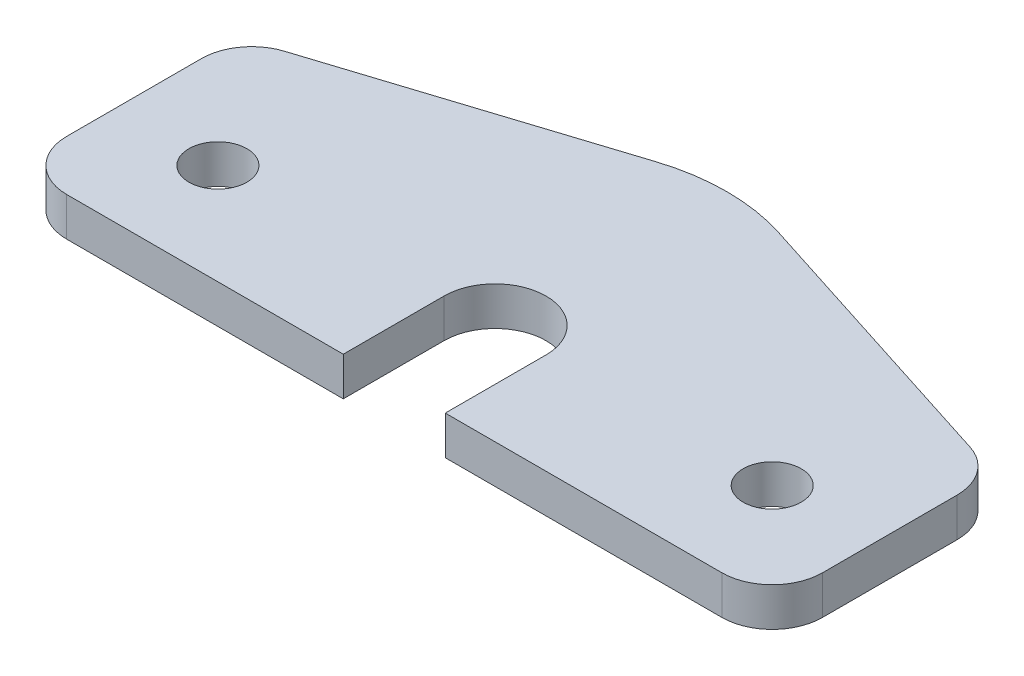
ISO-10303-21;
HEADER;
FILE_DESCRIPTION(('STEP AP214'),'2;1');
FILE_NAME('part.step','',(''),(''),'','','');
FILE_SCHEMA(('AUTOMOTIVE_DESIGN { 1 0 10303 214 1 1 1 1 }'));
ENDSEC;
DATA;
#1=APPLICATION_CONTEXT('core data for automotive mechanical design processes');
#2=APPLICATION_PROTOCOL_DEFINITION('international standard','automotive_design',2000,#1);
#3=PRODUCT_CONTEXT('',#1,'mechanical');
#4=PRODUCT('Part','Part','',(#3));
#5=PRODUCT_RELATED_PRODUCT_CATEGORY('part','',(#4));
#6=PRODUCT_DEFINITION_FORMATION('','',#4);
#7=PRODUCT_DEFINITION_CONTEXT('part definition',#1,'design');
#8=PRODUCT_DEFINITION('design','',#6,#7);
#9=PRODUCT_DEFINITION_SHAPE('','',#8);
#10=(LENGTH_UNIT() NAMED_UNIT(*) SI_UNIT(.MILLI.,.METRE.));
#11=(NAMED_UNIT(*) PLANE_ANGLE_UNIT() SI_UNIT($,.RADIAN.));
#12=(NAMED_UNIT(*) SI_UNIT($,.STERADIAN.) SOLID_ANGLE_UNIT());
#13=UNCERTAINTY_MEASURE_WITH_UNIT(LENGTH_MEASURE(1.E-05),#10,'distance_accuracy_value','');
#14=(GEOMETRIC_REPRESENTATION_CONTEXT(3) GLOBAL_UNCERTAINTY_ASSIGNED_CONTEXT((#13)) GLOBAL_UNIT_ASSIGNED_CONTEXT((#10,
#11,#12)) REPRESENTATION_CONTEXT('',''));
#15=CARTESIAN_POINT('',(0.,0.,0.));
#16=DIRECTION('',(0.,0.,1.));
#17=DIRECTION('',(1.,0.,0.));
#18=AXIS2_PLACEMENT_3D('',#15,#16,#17);
#19=CARTESIAN_POINT('',(0.,2.4384,-1.905));
#20=DIRECTION('',(0.,1.,0.));
#21=DIRECTION('',(0.,0.,1.));
#22=AXIS2_PLACEMENT_3D('',#19,#20,#21);
#23=PLANE('',#22);
#24=CARTESIAN_POINT('',(17.4625,2.4384,0.));
#25=DIRECTION('',(0.,1.,0.));
#26=DIRECTION('',(0.,0.,1.));
#27=AXIS2_PLACEMENT_3D('',#24,#25,#26);
#28=CIRCLE('',#27,1.8288);
#29=CARTESIAN_POINT('',(17.4625,2.4384,1.8288));
#30=VERTEX_POINT('',#29);
#31=EDGE_CURVE('E266',#30,#30,#28,.T.);
#32=ORIENTED_EDGE('',*,*,#31,.F.);
#33=EDGE_LOOP('',(#32));
#34=FACE_BOUND('',#33,.T.);
#35=DIRECTION('',(0.,0.,-1.));
#36=VECTOR('',#35,1.);
#37=CARTESIAN_POINT('',(23.8125,2.4384,6.35));
#38=LINE('',#37,#36);
#39=CARTESIAN_POINT('',(23.8125,2.4384,3.175));
#40=VERTEX_POINT('',#39);
#41=CARTESIAN_POINT('',(23.8125,2.4384,-5.30233425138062));
#42=VERTEX_POINT('',#41);
#43=EDGE_CURVE('E269',#40,#42,#38,.T.);
#44=ORIENTED_EDGE('',*,*,#43,.T.);
#45=CARTESIAN_POINT('',(20.6375,2.4384,-5.30233425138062));
#46=DIRECTION('',(0.,1.,0.));
#47=DIRECTION('',(0.,0.,1.));
#48=AXIS2_PLACEMENT_3D('',#45,#46,#47);
#49=CIRCLE('',#48,3.175);
#50=CARTESIAN_POINT('',(21.605079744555,2.4384,-8.32630753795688));
#51=VERTEX_POINT('',#50);
#52=EDGE_CURVE('E187',#42,#51,#49,.T.);
#53=ORIENTED_EDGE('',*,*,#52,.T.);
#54=DIRECTION('',(-0.952432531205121,0.,-0.304749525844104));
#55=VECTOR('',#54,1.);
#56=CARTESIAN_POINT('',(23.8125,2.4384,-7.62));
#57=LINE('',#56,#55);
#58=CARTESIAN_POINT('',(3.87031897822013,2.4384,-14.000893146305));
#59=VERTEX_POINT('',#58);
#60=EDGE_CURVE('E273',#51,#59,#57,.T.);
#61=ORIENTED_EDGE('',*,*,#60,.T.);
#62=CARTESIAN_POINT('',(0.,2.4384,-1.905));
#63=DIRECTION('',(0.,1.,0.));
#64=DIRECTION('',(0.,0.,1.));
#65=AXIS2_PLACEMENT_3D('',#62,#63,#64);
#66=CIRCLE('',#65,12.7);
#67=CARTESIAN_POINT('',(-3.87031897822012,2.4384,-14.000893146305));
#68=VERTEX_POINT('',#67);
#69=EDGE_CURVE('E262',#59,#68,#66,.T.);
#70=ORIENTED_EDGE('',*,*,#69,.T.);
#71=DIRECTION('',(-0.952432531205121,0.,0.304749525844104));
#72=VECTOR('',#71,1.);
#73=CARTESIAN_POINT('',(-23.8125,2.4384,-7.62));
#74=LINE('',#73,#72);
#75=CARTESIAN_POINT('',(-21.605079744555,2.4384,-8.32630753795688));
#76=VERTEX_POINT('',#75);
#77=EDGE_CURVE('E258',#68,#76,#74,.T.);
#78=ORIENTED_EDGE('',*,*,#77,.T.);
#79=CARTESIAN_POINT('',(-20.6375,2.4384,-5.30233425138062));
#80=DIRECTION('',(0.,1.,0.));
#81=DIRECTION('',(0.,0.,1.));
#82=AXIS2_PLACEMENT_3D('',#79,#80,#81);
#83=CIRCLE('',#82,3.175);
#84=CARTESIAN_POINT('',(-23.8125,2.4384,-5.30233425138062));
#85=VERTEX_POINT('',#84);
#86=EDGE_CURVE('E185',#76,#85,#83,.T.);
#87=ORIENTED_EDGE('',*,*,#86,.T.);
#88=DIRECTION('',(0.,0.,1.));
#89=VECTOR('',#88,1.);
#90=CARTESIAN_POINT('',(-23.8125,2.4384,6.35));
#91=LINE('',#90,#89);
#92=CARTESIAN_POINT('',(-23.8125,2.4384,3.175));
#93=VERTEX_POINT('',#92);
#94=EDGE_CURVE('E257',#85,#93,#91,.T.);
#95=ORIENTED_EDGE('',*,*,#94,.T.);
#96=CARTESIAN_POINT('',(-20.6375,2.4384,3.175));
#97=DIRECTION('',(0.,1.,0.));
#98=DIRECTION('',(0.,0.,1.));
#99=AXIS2_PLACEMENT_3D('',#96,#97,#98);
#100=CIRCLE('',#99,3.175);
#101=CARTESIAN_POINT('',(-20.6375,2.4384,6.35));
#102=VERTEX_POINT('',#101);
#103=EDGE_CURVE('E50',#93,#102,#100,.T.);
#104=ORIENTED_EDGE('',*,*,#103,.T.);
#105=DIRECTION('',(1.,0.,0.));
#106=VECTOR('',#105,1.);
#107=CARTESIAN_POINT('',(-23.8125,2.4384,6.35));
#108=LINE('',#107,#106);
#109=CARTESIAN_POINT('',(-3.2131,2.4384,6.35));
#110=VERTEX_POINT('',#109);
#111=EDGE_CURVE('E152',#102,#110,#108,.T.);
#112=ORIENTED_EDGE('',*,*,#111,.T.);
#113=DIRECTION('',(0.,0.,-1.));
#114=VECTOR('',#113,1.);
#115=CARTESIAN_POINT('',(-3.2131,2.4384,0.));
#116=LINE('',#115,#114);
#117=CARTESIAN_POINT('',(-3.2131,2.4384,0.));
#118=VERTEX_POINT('',#117);
#119=EDGE_CURVE('E147',#110,#118,#116,.T.);
#120=ORIENTED_EDGE('',*,*,#119,.T.);
#121=CARTESIAN_POINT('',(0.,2.4384,0.));
#122=DIRECTION('',(0.,-1.,0.));
#123=DIRECTION('',(0.,0.,1.));
#124=AXIS2_PLACEMENT_3D('',#121,#122,#123);
#125=CIRCLE('',#124,3.2131);
#126=CARTESIAN_POINT('',(3.2131,2.4384,0.));
#127=VERTEX_POINT('',#126);
#128=EDGE_CURVE('E137',#118,#127,#125,.T.);
#129=ORIENTED_EDGE('',*,*,#128,.T.);
#130=DIRECTION('',(0.,0.,1.));
#131=VECTOR('',#130,1.);
#132=CARTESIAN_POINT('',(3.2131,2.4384,0.));
#133=LINE('',#132,#131);
#134=CARTESIAN_POINT('',(3.2131,2.4384,6.35));
#135=VERTEX_POINT('',#134);
#136=EDGE_CURVE('E146',#127,#135,#133,.T.);
#137=ORIENTED_EDGE('',*,*,#136,.T.);
#138=DIRECTION('',(1.,0.,0.));
#139=VECTOR('',#138,1.);
#140=CARTESIAN_POINT('',(3.2131,2.4384,6.35));
#141=LINE('',#140,#139);
#142=CARTESIAN_POINT('',(20.6375,2.4384,6.35));
#143=VERTEX_POINT('',#142);
#144=EDGE_CURVE('E228',#135,#143,#141,.T.);
#145=ORIENTED_EDGE('',*,*,#144,.T.);
#146=CARTESIAN_POINT('',(20.6375,2.4384,3.175));
#147=DIRECTION('',(0.,1.,0.));
#148=DIRECTION('',(0.,0.,1.));
#149=AXIS2_PLACEMENT_3D('',#146,#147,#148);
#150=CIRCLE('',#149,3.175);
#151=EDGE_CURVE('E182',#143,#40,#150,.T.);
#152=ORIENTED_EDGE('',*,*,#151,.T.);
#153=EDGE_LOOP('',(#44,#53,#61,#70,#78,#87,#95,#104,#112,#120,#129,#137,#145,#152));
#154=FACE_BOUND('',#153,.T.);
#155=CARTESIAN_POINT('',(-17.4625,2.4384,0.));
#156=DIRECTION('',(0.,1.,0.));
#157=DIRECTION('',(0.,0.,-1.));
#158=AXIS2_PLACEMENT_3D('',#155,#156,#157);
#159=CIRCLE('',#158,1.8288);
#160=CARTESIAN_POINT('',(-17.4625,2.4384,-1.8288));
#161=VERTEX_POINT('',#160);
#162=EDGE_CURVE('E447',#161,#161,#159,.T.);
#163=ORIENTED_EDGE('',*,*,#162,.F.);
#164=EDGE_LOOP('',(#163));
#165=FACE_BOUND('',#164,.T.);
#166=ADVANCED_FACE('F35',(#34,#154,#165),#23,.T.);
#167=CARTESIAN_POINT('',(0.,0.,-1.905));
#168=DIRECTION('',(0.,1.,0.));
#169=DIRECTION('',(0.,0.,1.));
#170=AXIS2_PLACEMENT_3D('',#167,#168,#169);
#171=PLANE('',#170);
#172=CARTESIAN_POINT('',(17.4625,0.,0.));
#173=DIRECTION('',(0.,1.,0.));
#174=DIRECTION('',(0.,0.,1.));
#175=AXIS2_PLACEMENT_3D('',#172,#173,#174);
#176=CIRCLE('',#175,1.8288);
#177=CARTESIAN_POINT('',(17.4625,0.,1.8288));
#178=VERTEX_POINT('',#177);
#179=EDGE_CURVE('E446',#178,#178,#176,.T.);
#180=ORIENTED_EDGE('',*,*,#179,.T.);
#181=EDGE_LOOP('',(#180));
#182=FACE_BOUND('',#181,.T.);
#183=DIRECTION('',(-0.952432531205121,0.,-0.304749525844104));
#184=VECTOR('',#183,1.);
#185=CARTESIAN_POINT('',(23.8125,0.,-7.62));
#186=LINE('',#185,#184);
#187=CARTESIAN_POINT('',(21.605079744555,0.,-8.32630753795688));
#188=VERTEX_POINT('',#187);
#189=CARTESIAN_POINT('',(3.87031897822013,0.,-14.000893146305));
#190=VERTEX_POINT('',#189);
#191=EDGE_CURVE('E236',#188,#190,#186,.T.);
#192=ORIENTED_EDGE('',*,*,#191,.F.);
#193=CARTESIAN_POINT('',(20.6375,0.,-5.30233425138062));
#194=DIRECTION('',(0.,1.,0.));
#195=DIRECTION('',(0.,0.,1.));
#196=AXIS2_PLACEMENT_3D('',#193,#194,#195);
#197=CIRCLE('',#196,3.175);
#198=CARTESIAN_POINT('',(23.8125,0.,-5.30233425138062));
#199=VERTEX_POINT('',#198);
#200=EDGE_CURVE('E175',#188,#199,#197,.F.);
#201=ORIENTED_EDGE('',*,*,#200,.T.);
#202=DIRECTION('',(0.,0.,-1.));
#203=VECTOR('',#202,1.);
#204=CARTESIAN_POINT('',(23.8125,0.,6.35));
#205=LINE('',#204,#203);
#206=CARTESIAN_POINT('',(23.8125,0.,3.175));
#207=VERTEX_POINT('',#206);
#208=EDGE_CURVE('E233',#207,#199,#205,.T.);
#209=ORIENTED_EDGE('',*,*,#208,.F.);
#210=CARTESIAN_POINT('',(20.6375,0.,3.175));
#211=DIRECTION('',(0.,1.,0.));
#212=DIRECTION('',(0.,0.,1.));
#213=AXIS2_PLACEMENT_3D('',#210,#211,#212);
#214=CIRCLE('',#213,3.175);
#215=CARTESIAN_POINT('',(20.6375,0.,6.35));
#216=VERTEX_POINT('',#215);
#217=EDGE_CURVE('E164',#207,#216,#214,.F.);
#218=ORIENTED_EDGE('',*,*,#217,.T.);
#219=DIRECTION('',(1.,0.,0.));
#220=VECTOR('',#219,1.);
#221=CARTESIAN_POINT('',(3.2131,0.,6.35));
#222=LINE('',#221,#220);
#223=CARTESIAN_POINT('',(3.2131,0.,6.35));
#224=VERTEX_POINT('',#223);
#225=EDGE_CURVE('E225',#224,#216,#222,.T.);
#226=ORIENTED_EDGE('',*,*,#225,.F.);
#227=DIRECTION('',(0.,0.,1.));
#228=VECTOR('',#227,1.);
#229=CARTESIAN_POINT('',(3.2131,0.,0.));
#230=LINE('',#229,#228);
#231=CARTESIAN_POINT('',(3.2131,0.,0.));
#232=VERTEX_POINT('',#231);
#233=EDGE_CURVE('E231',#232,#224,#230,.T.);
#234=ORIENTED_EDGE('',*,*,#233,.F.);
#235=CARTESIAN_POINT('',(0.,0.,0.));
#236=DIRECTION('',(0.,-1.,0.));
#237=DIRECTION('',(0.,0.,1.));
#238=AXIS2_PLACEMENT_3D('',#235,#236,#237);
#239=CIRCLE('',#238,3.2131);
#240=CARTESIAN_POINT('',(-3.2131,0.,0.));
#241=VERTEX_POINT('',#240);
#242=EDGE_CURVE('E238',#241,#232,#239,.T.);
#243=ORIENTED_EDGE('',*,*,#242,.F.);
#244=DIRECTION('',(0.,0.,-1.));
#245=VECTOR('',#244,1.);
#246=CARTESIAN_POINT('',(-3.2131,0.,0.));
#247=LINE('',#246,#245);
#248=CARTESIAN_POINT('',(-3.2131,0.,6.35));
#249=VERTEX_POINT('',#248);
#250=EDGE_CURVE('E160',#249,#241,#247,.T.);
#251=ORIENTED_EDGE('',*,*,#250,.F.);
#252=DIRECTION('',(1.,0.,0.));
#253=VECTOR('',#252,1.);
#254=CARTESIAN_POINT('',(-23.8125,0.,6.35));
#255=LINE('',#254,#253);
#256=CARTESIAN_POINT('',(-20.6375,0.,6.35));
#257=VERTEX_POINT('',#256);
#258=EDGE_CURVE('E156',#257,#249,#255,.T.);
#259=ORIENTED_EDGE('',*,*,#258,.F.);
#260=CARTESIAN_POINT('',(-20.6375,0.,3.175));
#261=DIRECTION('',(0.,1.,0.));
#262=DIRECTION('',(0.,0.,1.));
#263=AXIS2_PLACEMENT_3D('',#260,#261,#262);
#264=CIRCLE('',#263,3.175);
#265=CARTESIAN_POINT('',(-23.8125,0.,3.175));
#266=VERTEX_POINT('',#265);
#267=EDGE_CURVE('E171',#257,#266,#264,.F.);
#268=ORIENTED_EDGE('',*,*,#267,.T.);
#269=DIRECTION('',(0.,0.,1.));
#270=VECTOR('',#269,1.);
#271=CARTESIAN_POINT('',(-23.8125,0.,6.35));
#272=LINE('',#271,#270);
#273=CARTESIAN_POINT('',(-23.8125,0.,-5.30233425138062));
#274=VERTEX_POINT('',#273);
#275=EDGE_CURVE('E205',#274,#266,#272,.T.);
#276=ORIENTED_EDGE('',*,*,#275,.F.);
#277=CARTESIAN_POINT('',(-20.6375,0.,-5.30233425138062));
#278=DIRECTION('',(0.,1.,0.));
#279=DIRECTION('',(0.,0.,1.));
#280=AXIS2_PLACEMENT_3D('',#277,#278,#279);
#281=CIRCLE('',#280,3.175);
#282=CARTESIAN_POINT('',(-21.605079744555,0.,-8.32630753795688));
#283=VERTEX_POINT('',#282);
#284=EDGE_CURVE('E173',#274,#283,#281,.F.);
#285=ORIENTED_EDGE('',*,*,#284,.T.);
#286=DIRECTION('',(-0.952432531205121,0.,0.304749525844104));
#287=VECTOR('',#286,1.);
#288=CARTESIAN_POINT('',(-23.8125,0.,-7.62));
#289=LINE('',#288,#287);
#290=CARTESIAN_POINT('',(-3.87031897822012,0.,-14.000893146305));
#291=VERTEX_POINT('',#290);
#292=EDGE_CURVE('E207',#291,#283,#289,.T.);
#293=ORIENTED_EDGE('',*,*,#292,.F.);
#294=CARTESIAN_POINT('',(0.,0.,-1.905));
#295=DIRECTION('',(0.,1.,0.));
#296=DIRECTION('',(0.,0.,1.));
#297=AXIS2_PLACEMENT_3D('',#294,#295,#296);
#298=CIRCLE('',#297,12.7);
#299=EDGE_CURVE('E243',#190,#291,#298,.T.);
#300=ORIENTED_EDGE('',*,*,#299,.F.);
#301=EDGE_LOOP('',(#192,#201,#209,#218,#226,#234,#243,#251,#259,#268,#276,#285,#293,#300));
#302=FACE_BOUND('',#301,.T.);
#303=CARTESIAN_POINT('',(-17.4625,0.,0.));
#304=DIRECTION('',(0.,1.,0.));
#305=DIRECTION('',(0.,0.,-1.));
#306=AXIS2_PLACEMENT_3D('',#303,#304,#305);
#307=CIRCLE('',#306,1.8288);
#308=CARTESIAN_POINT('',(-17.4625,0.,-1.8288));
#309=VERTEX_POINT('',#308);
#310=EDGE_CURVE('E451',#309,#309,#307,.T.);
#311=ORIENTED_EDGE('',*,*,#310,.T.);
#312=EDGE_LOOP('',(#311));
#313=FACE_BOUND('',#312,.T.);
#314=ADVANCED_FACE('F202',(#182,#302,#313),#171,.F.);
#315=CARTESIAN_POINT('',(-3.2131,2.4384,0.));
#316=DIRECTION('',(-1.,0.,0.));
#317=DIRECTION('',(0.,0.,1.));
#318=AXIS2_PLACEMENT_3D('',#315,#316,#317);
#319=PLANE('',#318);
#320=ORIENTED_EDGE('',*,*,#250,.T.);
#321=DIRECTION('',(0.,-1.,0.));
#322=VECTOR('',#321,1.);
#323=CARTESIAN_POINT('',(-3.2131,2.4384,0.));
#324=LINE('',#323,#322);
#325=EDGE_CURVE('E141',#118,#241,#324,.T.);
#326=ORIENTED_EDGE('',*,*,#325,.F.);
#327=ORIENTED_EDGE('',*,*,#119,.F.);
#328=DIRECTION('',(0.,-1.,0.));
#329=VECTOR('',#328,1.);
#330=CARTESIAN_POINT('',(-3.2131,2.4384,6.35));
#331=LINE('',#330,#329);
#332=EDGE_CURVE('E211',#110,#249,#331,.T.);
#333=ORIENTED_EDGE('',*,*,#332,.T.);
#334=EDGE_LOOP('',(#320,#326,#327,#333));
#335=FACE_BOUND('',#334,.T.);
#336=ADVANCED_FACE('F158',(#335),#319,.F.);
#337=CARTESIAN_POINT('',(0.,2.4384,0.));
#338=DIRECTION('',(0.,-1.,0.));
#339=DIRECTION('',(0.,0.,-1.));
#340=AXIS2_PLACEMENT_3D('',#337,#338,#339);
#341=CYLINDRICAL_SURFACE('',#340,3.2131);
#342=ORIENTED_EDGE('',*,*,#242,.T.);
#343=DIRECTION('',(0.,-1.,0.));
#344=VECTOR('',#343,1.);
#345=CARTESIAN_POINT('',(3.2131,2.4384,0.));
#346=LINE('',#345,#344);
#347=EDGE_CURVE('E144',#127,#232,#346,.T.);
#348=ORIENTED_EDGE('',*,*,#347,.F.);
#349=ORIENTED_EDGE('',*,*,#128,.F.);
#350=ORIENTED_EDGE('',*,*,#325,.T.);
#351=EDGE_LOOP('',(#342,#348,#349,#350));
#352=FACE_BOUND('',#351,.T.);
#353=ADVANCED_FACE('F139',(#352),#341,.F.);
#354=CARTESIAN_POINT('',(3.2131,2.4384,0.));
#355=DIRECTION('',(1.,0.,0.));
#356=DIRECTION('',(0.,0.,-1.));
#357=AXIS2_PLACEMENT_3D('',#354,#355,#356);
#358=PLANE('',#357);
#359=ORIENTED_EDGE('',*,*,#233,.T.);
#360=DIRECTION('',(0.,-1.,0.));
#361=VECTOR('',#360,1.);
#362=CARTESIAN_POINT('',(3.2131,2.4384,6.35));
#363=LINE('',#362,#361);
#364=EDGE_CURVE('E166',#135,#224,#363,.T.);
#365=ORIENTED_EDGE('',*,*,#364,.F.);
#366=ORIENTED_EDGE('',*,*,#136,.F.);
#367=ORIENTED_EDGE('',*,*,#347,.T.);
#368=EDGE_LOOP('',(#359,#365,#366,#367));
#369=FACE_BOUND('',#368,.T.);
#370=ADVANCED_FACE('F267',(#369),#358,.F.);
#371=CARTESIAN_POINT('',(3.2131,2.4384,6.35));
#372=DIRECTION('',(0.,0.,-1.));
#373=DIRECTION('',(-1.,0.,0.));
#374=AXIS2_PLACEMENT_3D('',#371,#372,#373);
#375=PLANE('',#374);
#376=ORIENTED_EDGE('',*,*,#225,.T.);
#377=DIRECTION('',(0.,-1.,0.));
#378=VECTOR('',#377,1.);
#379=CARTESIAN_POINT('',(20.6375,2.4384,6.35));
#380=LINE('',#379,#378);
#381=EDGE_CURVE('E11',#216,#143,#380,.F.);
#382=ORIENTED_EDGE('',*,*,#381,.T.);
#383=ORIENTED_EDGE('',*,*,#144,.F.);
#384=ORIENTED_EDGE('',*,*,#364,.T.);
#385=EDGE_LOOP('',(#376,#382,#383,#384));
#386=FACE_BOUND('',#385,.T.);
#387=ADVANCED_FACE('F224',(#386),#375,.F.);
#388=CARTESIAN_POINT('',(23.8125,2.4384,6.35));
#389=DIRECTION('',(-1.,0.,0.));
#390=DIRECTION('',(0.,0.,1.));
#391=AXIS2_PLACEMENT_3D('',#388,#389,#390);
#392=PLANE('',#391);
#393=ORIENTED_EDGE('',*,*,#208,.T.);
#394=DIRECTION('',(0.,-1.,0.));
#395=VECTOR('',#394,1.);
#396=CARTESIAN_POINT('',(23.8125,2.4384,-5.30233425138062));
#397=LINE('',#396,#395);
#398=EDGE_CURVE('E180',#199,#42,#397,.F.);
#399=ORIENTED_EDGE('',*,*,#398,.T.);
#400=ORIENTED_EDGE('',*,*,#43,.F.);
#401=DIRECTION('',(0.,-1.,0.));
#402=VECTOR('',#401,1.);
#403=CARTESIAN_POINT('',(23.8125,2.4384,3.175));
#404=LINE('',#403,#402);
#405=EDGE_CURVE('E177',#40,#207,#404,.T.);
#406=ORIENTED_EDGE('',*,*,#405,.T.);
#407=EDGE_LOOP('',(#393,#399,#400,#406));
#408=FACE_BOUND('',#407,.T.);
#409=ADVANCED_FACE('F288',(#408),#392,.F.);
#410=CARTESIAN_POINT('',(23.8125,2.4384,-7.62));
#411=DIRECTION('',(-0.304749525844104,0.,0.952432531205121));
#412=DIRECTION('',(0.952432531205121,0.,0.304749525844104));
#413=AXIS2_PLACEMENT_3D('',#410,#411,#412);
#414=PLANE('',#413);
#415=ORIENTED_EDGE('',*,*,#60,.F.);
#416=DIRECTION('',(0.,-1.,0.));
#417=VECTOR('',#416,1.);
#418=CARTESIAN_POINT('',(21.605079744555,2.4384,-8.32630753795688));
#419=LINE('',#418,#417);
#420=EDGE_CURVE('E161',#51,#188,#419,.T.);
#421=ORIENTED_EDGE('',*,*,#420,.T.);
#422=ORIENTED_EDGE('',*,*,#191,.T.);
#423=DIRECTION('',(0.,-1.,0.));
#424=VECTOR('',#423,1.);
#425=CARTESIAN_POINT('',(3.87031897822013,2.4384,-14.000893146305));
#426=LINE('',#425,#424);
#427=EDGE_CURVE('E216',#59,#190,#426,.T.);
#428=ORIENTED_EDGE('',*,*,#427,.F.);
#429=EDGE_LOOP('',(#415,#421,#422,#428));
#430=FACE_BOUND('',#429,.T.);
#431=ADVANCED_FACE('F280',(#430),#414,.F.);
#432=CARTESIAN_POINT('',(0.,2.4384,-1.905));
#433=DIRECTION('',(0.,-1.,0.));
#434=DIRECTION('',(0.,0.,-1.));
#435=AXIS2_PLACEMENT_3D('',#432,#433,#434);
#436=CYLINDRICAL_SURFACE('',#435,12.7);
#437=ORIENTED_EDGE('',*,*,#299,.T.);
#438=DIRECTION('',(0.,-1.,0.));
#439=VECTOR('',#438,1.);
#440=CARTESIAN_POINT('',(-3.87031897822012,2.4384,-14.000893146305));
#441=LINE('',#440,#439);
#442=EDGE_CURVE('E213',#68,#291,#441,.T.);
#443=ORIENTED_EDGE('',*,*,#442,.F.);
#444=ORIENTED_EDGE('',*,*,#69,.F.);
#445=ORIENTED_EDGE('',*,*,#427,.T.);
#446=EDGE_LOOP('',(#437,#443,#444,#445));
#447=FACE_BOUND('',#446,.T.);
#448=ADVANCED_FACE('F278',(#447),#436,.T.);
#449=CARTESIAN_POINT('',(-23.8125,2.4384,-7.62));
#450=DIRECTION('',(0.304749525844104,0.,0.952432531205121));
#451=DIRECTION('',(0.952432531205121,0.,-0.304749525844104));
#452=AXIS2_PLACEMENT_3D('',#449,#450,#451);
#453=PLANE('',#452);
#454=ORIENTED_EDGE('',*,*,#292,.T.);
#455=DIRECTION('',(0.,-1.,0.));
#456=VECTOR('',#455,1.);
#457=CARTESIAN_POINT('',(-21.605079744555,2.4384,-8.32630753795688));
#458=LINE('',#457,#456);
#459=EDGE_CURVE('E193',#283,#76,#458,.F.);
#460=ORIENTED_EDGE('',*,*,#459,.T.);
#461=ORIENTED_EDGE('',*,*,#77,.F.);
#462=ORIENTED_EDGE('',*,*,#442,.T.);
#463=EDGE_LOOP('',(#454,#460,#461,#462));
#464=FACE_BOUND('',#463,.T.);
#465=ADVANCED_FACE('F248',(#464),#453,.F.);
#466=CARTESIAN_POINT('',(-23.8125,2.4384,6.35));
#467=DIRECTION('',(1.,0.,0.));
#468=DIRECTION('',(0.,0.,-1.));
#469=AXIS2_PLACEMENT_3D('',#466,#467,#468);
#470=PLANE('',#469);
#471=ORIENTED_EDGE('',*,*,#94,.F.);
#472=DIRECTION('',(0.,-1.,0.));
#473=VECTOR('',#472,1.);
#474=CARTESIAN_POINT('',(-23.8125,2.4384,-5.30233425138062));
#475=LINE('',#474,#473);
#476=EDGE_CURVE('E190',#85,#274,#475,.T.);
#477=ORIENTED_EDGE('',*,*,#476,.T.);
#478=ORIENTED_EDGE('',*,*,#275,.T.);
#479=DIRECTION('',(0.,-1.,0.));
#480=VECTOR('',#479,1.);
#481=CARTESIAN_POINT('',(-23.8125,2.4384,3.175));
#482=LINE('',#481,#480);
#483=EDGE_CURVE('E58',#266,#93,#482,.F.);
#484=ORIENTED_EDGE('',*,*,#483,.T.);
#485=EDGE_LOOP('',(#471,#477,#478,#484));
#486=FACE_BOUND('',#485,.T.);
#487=ADVANCED_FACE('F259',(#486),#470,.F.);
#488=CARTESIAN_POINT('',(-23.8125,2.4384,6.35));
#489=DIRECTION('',(0.,0.,-1.));
#490=DIRECTION('',(-1.,0.,0.));
#491=AXIS2_PLACEMENT_3D('',#488,#489,#490);
#492=PLANE('',#491);
#493=ORIENTED_EDGE('',*,*,#111,.F.);
#494=DIRECTION('',(0.,-1.,0.));
#495=VECTOR('',#494,1.);
#496=CARTESIAN_POINT('',(-20.6375,2.4384,6.35));
#497=LINE('',#496,#495);
#498=EDGE_CURVE('E43',#102,#257,#497,.T.);
#499=ORIENTED_EDGE('',*,*,#498,.T.);
#500=ORIENTED_EDGE('',*,*,#258,.T.);
#501=ORIENTED_EDGE('',*,*,#332,.F.);
#502=EDGE_LOOP('',(#493,#499,#500,#501));
#503=FACE_BOUND('',#502,.T.);
#504=ADVANCED_FACE('F198',(#503),#492,.F.);
#505=CARTESIAN_POINT('',(17.4625,2.4384,0.));
#506=DIRECTION('',(0.,-1.,0.));
#507=DIRECTION('',(0.,0.,-1.));
#508=AXIS2_PLACEMENT_3D('',#505,#506,#507);
#509=CYLINDRICAL_SURFACE('',#508,1.8288);
#510=ORIENTED_EDGE('',*,*,#31,.T.);
#511=EDGE_LOOP('',(#510));
#512=FACE_BOUND('',#511,.T.);
#513=ORIENTED_EDGE('',*,*,#179,.F.);
#514=EDGE_LOOP('',(#513));
#515=FACE_BOUND('',#514,.T.);
#516=ADVANCED_FACE('F307',(#512,#515),#509,.F.);
#517=CARTESIAN_POINT('',(-17.4625,2.4384,0.));
#518=DIRECTION('',(0.,-1.,0.));
#519=DIRECTION('',(0.,0.,-1.));
#520=AXIS2_PLACEMENT_3D('',#517,#518,#519);
#521=CYLINDRICAL_SURFACE('',#520,1.8288);
#522=ORIENTED_EDGE('',*,*,#162,.T.);
#523=EDGE_LOOP('',(#522));
#524=FACE_BOUND('',#523,.T.);
#525=ORIENTED_EDGE('',*,*,#310,.F.);
#526=EDGE_LOOP('',(#525));
#527=FACE_BOUND('',#526,.T.);
#528=ADVANCED_FACE('F332',(#524,#527),#521,.F.);
#529=CARTESIAN_POINT('',(20.6375,2.4384,-5.30233425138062));
#530=DIRECTION('',(0.,-1.,0.));
#531=DIRECTION('',(0.,0.,-1.));
#532=AXIS2_PLACEMENT_3D('',#529,#530,#531);
#533=CYLINDRICAL_SURFACE('',#532,3.175);
#534=ORIENTED_EDGE('',*,*,#52,.F.);
#535=ORIENTED_EDGE('',*,*,#398,.F.);
#536=ORIENTED_EDGE('',*,*,#200,.F.);
#537=ORIENTED_EDGE('',*,*,#420,.F.);
#538=EDGE_LOOP('',(#534,#535,#536,#537));
#539=FACE_BOUND('',#538,.T.);
#540=ADVANCED_FACE('F284',(#539),#533,.T.);
#541=CARTESIAN_POINT('',(-20.6375,2.4384,-5.30233425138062));
#542=DIRECTION('',(0.,-1.,0.));
#543=DIRECTION('',(0.,0.,-1.));
#544=AXIS2_PLACEMENT_3D('',#541,#542,#543);
#545=CYLINDRICAL_SURFACE('',#544,3.175);
#546=ORIENTED_EDGE('',*,*,#86,.F.);
#547=ORIENTED_EDGE('',*,*,#459,.F.);
#548=ORIENTED_EDGE('',*,*,#284,.F.);
#549=ORIENTED_EDGE('',*,*,#476,.F.);
#550=EDGE_LOOP('',(#546,#547,#548,#549));
#551=FACE_BOUND('',#550,.T.);
#552=ADVANCED_FACE('F255',(#551),#545,.T.);
#553=CARTESIAN_POINT('',(-20.6375,2.4384,3.175));
#554=DIRECTION('',(0.,-1.,0.));
#555=DIRECTION('',(0.,0.,-1.));
#556=AXIS2_PLACEMENT_3D('',#553,#554,#555);
#557=CYLINDRICAL_SURFACE('',#556,3.175);
#558=ORIENTED_EDGE('',*,*,#103,.F.);
#559=ORIENTED_EDGE('',*,*,#483,.F.);
#560=ORIENTED_EDGE('',*,*,#267,.F.);
#561=ORIENTED_EDGE('',*,*,#498,.F.);
#562=EDGE_LOOP('',(#558,#559,#560,#561));
#563=FACE_BOUND('',#562,.T.);
#564=ADVANCED_FACE('F293',(#563),#557,.T.);
#565=CARTESIAN_POINT('',(20.6375,2.4384,3.175));
#566=DIRECTION('',(0.,-1.,0.));
#567=DIRECTION('',(0.,0.,-1.));
#568=AXIS2_PLACEMENT_3D('',#565,#566,#567);
#569=CYLINDRICAL_SURFACE('',#568,3.175);
#570=ORIENTED_EDGE('',*,*,#151,.F.);
#571=ORIENTED_EDGE('',*,*,#381,.F.);
#572=ORIENTED_EDGE('',*,*,#217,.F.);
#573=ORIENTED_EDGE('',*,*,#405,.F.);
#574=EDGE_LOOP('',(#570,#571,#572,#573));
#575=FACE_BOUND('',#574,.T.);
#576=ADVANCED_FACE('F37',(#575),#569,.T.);
#577=CLOSED_SHELL('',(#166,#314,#336,#353,#370,#387,#409,#431,#448,#465,#487,#504,#516,#528,
#540,#552,#564,#576));
#578=MANIFOLD_SOLID_BREP('B2',#577);
#579=ADVANCED_BREP_SHAPE_REPRESENTATION('',(#18,#578),#14);
#580=SHAPE_DEFINITION_REPRESENTATION(#9,#579);
ENDSEC;
END-ISO-10303-21;
